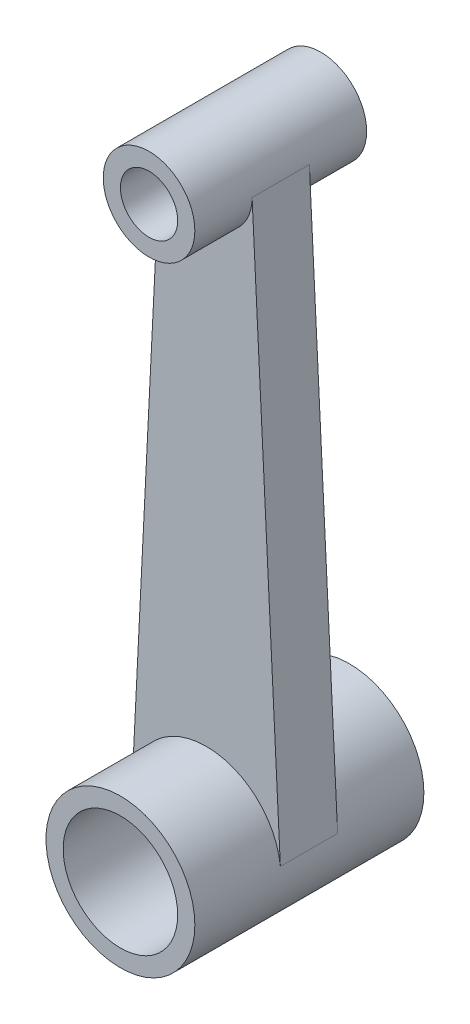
ISO-10303-21;
HEADER;
FILE_DESCRIPTION(('STEP AP214'),'2;1');
FILE_NAME('part.step','',(''),(''),'','','');
FILE_SCHEMA(('AUTOMOTIVE_DESIGN { 1 0 10303 214 1 1 1 1 }'));
ENDSEC;
DATA;
#1=APPLICATION_CONTEXT('core data for automotive mechanical design processes');
#2=APPLICATION_PROTOCOL_DEFINITION('international standard','automotive_design',2000,#1);
#3=PRODUCT_CONTEXT('',#1,'mechanical');
#4=PRODUCT('Part','Part','',(#3));
#5=PRODUCT_RELATED_PRODUCT_CATEGORY('part','',(#4));
#6=PRODUCT_DEFINITION_FORMATION('','',#4);
#7=PRODUCT_DEFINITION_CONTEXT('part definition',#1,'design');
#8=PRODUCT_DEFINITION('design','',#6,#7);
#9=PRODUCT_DEFINITION_SHAPE('','',#8);
#10=(LENGTH_UNIT() NAMED_UNIT(*) SI_UNIT(.MILLI.,.METRE.));
#11=(NAMED_UNIT(*) PLANE_ANGLE_UNIT() SI_UNIT($,.RADIAN.));
#12=(NAMED_UNIT(*) SI_UNIT($,.STERADIAN.) SOLID_ANGLE_UNIT());
#13=UNCERTAINTY_MEASURE_WITH_UNIT(LENGTH_MEASURE(1.E-05),#10,'distance_accuracy_value','');
#14=(GEOMETRIC_REPRESENTATION_CONTEXT(3) GLOBAL_UNCERTAINTY_ASSIGNED_CONTEXT((#13)) GLOBAL_UNIT_ASSIGNED_CONTEXT((#10,
#11,#12)) REPRESENTATION_CONTEXT('',''));
#15=CARTESIAN_POINT('',(0.,0.,0.));
#16=DIRECTION('',(0.,0.,1.));
#17=DIRECTION('',(1.,0.,0.));
#18=AXIS2_PLACEMENT_3D('',#15,#16,#17);
#19=CARTESIAN_POINT('',(0.,0.,-19.05));
#20=DIRECTION('',(0.,0.,1.));
#21=DIRECTION('',(1.,0.,0.));
#22=AXIS2_PLACEMENT_3D('',#19,#20,#21);
#23=CYLINDRICAL_SURFACE('',#22,10.16);
#24=CARTESIAN_POINT('',(0.,0.,-19.05));
#25=DIRECTION('',(0.,0.,1.));
#26=DIRECTION('',(1.,0.,0.));
#27=AXIS2_PLACEMENT_3D('',#24,#25,#26);
#28=CIRCLE('',#27,10.16);
#29=CARTESIAN_POINT('',(10.16,0.,-19.05));
#30=VERTEX_POINT('',#29);
#31=EDGE_CURVE('E11',#30,#30,#28,.T.);
#32=ORIENTED_EDGE('',*,*,#31,.T.);
#33=EDGE_LOOP('',(#32));
#34=FACE_BOUND('',#33,.T.);
#35=CARTESIAN_POINT('',(0.,0.,19.05));
#36=DIRECTION('',(0.,0.,1.));
#37=DIRECTION('',(1.,0.,0.));
#38=AXIS2_PLACEMENT_3D('',#35,#36,#37);
#39=CIRCLE('',#38,10.16);
#40=CARTESIAN_POINT('',(10.16,0.,19.05));
#41=VERTEX_POINT('',#40);
#42=EDGE_CURVE('E117',#41,#41,#39,.T.);
#43=ORIENTED_EDGE('',*,*,#42,.F.);
#44=EDGE_LOOP('',(#43));
#45=FACE_BOUND('',#44,.T.);
#46=DIRECTION('',(0.,0.,1.));
#47=VECTOR('',#46,1.);
#48=CARTESIAN_POINT('',(10.16,0.,-6.35));
#49=LINE('',#48,#47);
#50=CARTESIAN_POINT('',(10.16,0.,-6.35));
#51=VERTEX_POINT('',#50);
#52=CARTESIAN_POINT('',(10.16,0.,6.35));
#53=VERTEX_POINT('',#52);
#54=EDGE_CURVE('E52',#51,#53,#49,.T.);
#55=ORIENTED_EDGE('',*,*,#54,.F.);
#56=CARTESIAN_POINT('',(0.,0.,-6.35));
#57=DIRECTION('',(0.,0.,1.));
#58=DIRECTION('',(1.,0.,0.));
#59=AXIS2_PLACEMENT_3D('',#56,#57,#58);
#60=CIRCLE('',#59,10.16);
#61=CARTESIAN_POINT('',(-10.16,0.,-6.35));
#62=VERTEX_POINT('',#61);
#63=EDGE_CURVE('E47',#62,#51,#60,.T.);
#64=ORIENTED_EDGE('',*,*,#63,.F.);
#65=DIRECTION('',(0.,0.,1.));
#66=VECTOR('',#65,1.);
#67=CARTESIAN_POINT('',(-10.16,0.,-6.35));
#68=LINE('',#67,#66);
#69=CARTESIAN_POINT('',(-10.16,0.,6.35));
#70=VERTEX_POINT('',#69);
#71=EDGE_CURVE('E91',#62,#70,#68,.T.);
#72=ORIENTED_EDGE('',*,*,#71,.T.);
#73=CARTESIAN_POINT('',(0.,0.,6.35));
#74=DIRECTION('',(0.,0.,1.));
#75=DIRECTION('',(1.,0.,0.));
#76=AXIS2_PLACEMENT_3D('',#73,#74,#75);
#77=CIRCLE('',#76,10.16);
#78=EDGE_CURVE('E78',#70,#53,#77,.T.);
#79=ORIENTED_EDGE('',*,*,#78,.T.);
#80=EDGE_LOOP('',(#55,#64,#72,#79));
#81=FACE_BOUND('',#80,.T.);
#82=ADVANCED_FACE('F33',(#34,#45,#81),#23,.T.);
#83=CARTESIAN_POINT('',(0.,0.,-19.05));
#84=DIRECTION('',(0.,0.,1.));
#85=DIRECTION('',(1.,0.,0.));
#86=AXIS2_PLACEMENT_3D('',#83,#84,#85);
#87=PLANE('',#86);
#88=CARTESIAN_POINT('',(0.,0.,-19.05));
#89=DIRECTION('',(0.,0.,1.));
#90=DIRECTION('',(1.,0.,0.));
#91=AXIS2_PLACEMENT_3D('',#88,#89,#90);
#92=CIRCLE('',#91,6.35);
#93=CARTESIAN_POINT('',(6.35,0.,-19.05));
#94=VERTEX_POINT('',#93);
#95=EDGE_CURVE('E40',#94,#94,#92,.T.);
#96=ORIENTED_EDGE('',*,*,#95,.T.);
#97=EDGE_LOOP('',(#96));
#98=FACE_BOUND('',#97,.T.);
#99=ORIENTED_EDGE('',*,*,#31,.F.);
#100=EDGE_LOOP('',(#99));
#101=FACE_BOUND('',#100,.T.);
#102=ADVANCED_FACE('F122',(#98,#101),#87,.F.);
#103=CARTESIAN_POINT('',(0.,0.,-19.05));
#104=DIRECTION('',(0.,0.,1.));
#105=DIRECTION('',(1.,0.,0.));
#106=AXIS2_PLACEMENT_3D('',#103,#104,#105);
#107=CYLINDRICAL_SURFACE('',#106,6.35);
#108=CARTESIAN_POINT('',(0.,0.,19.05));
#109=DIRECTION('',(0.,0.,1.));
#110=DIRECTION('',(1.,0.,0.));
#111=AXIS2_PLACEMENT_3D('',#108,#109,#110);
#112=CIRCLE('',#111,6.35);
#113=CARTESIAN_POINT('',(6.35,0.,19.05));
#114=VERTEX_POINT('',#113);
#115=EDGE_CURVE('E90',#114,#114,#112,.T.);
#116=CARTESIAN_POINT('',(6.35,0.,-19.05));
#117=CARTESIAN_POINT('',(6.35,0.,-18.653125));
#118=CARTESIAN_POINT('',(6.35,0.,-18.25625));
#119=CARTESIAN_POINT('',(6.35,0.,-17.4625));
#120=CARTESIAN_POINT('',(6.35,0.,-17.065625));
#121=CARTESIAN_POINT('',(6.35,0.,-16.271875));
#122=CARTESIAN_POINT('',(6.35,0.,-15.875));
#123=CARTESIAN_POINT('',(6.35,0.,-15.08125));
#124=CARTESIAN_POINT('',(6.35,0.,-14.684375));
#125=CARTESIAN_POINT('',(6.35,0.,-13.890625));
#126=CARTESIAN_POINT('',(6.35,0.,-13.49375));
#127=CARTESIAN_POINT('',(6.35,0.,-12.7));
#128=CARTESIAN_POINT('',(6.35,0.,-12.303125));
#129=CARTESIAN_POINT('',(6.35,0.,-11.509375));
#130=CARTESIAN_POINT('',(6.35,0.,-11.1125));
#131=CARTESIAN_POINT('',(6.35,0.,-10.31875));
#132=CARTESIAN_POINT('',(6.35,0.,-9.921875));
#133=CARTESIAN_POINT('',(6.35,0.,-9.128125));
#134=CARTESIAN_POINT('',(6.35,0.,-8.73125));
#135=CARTESIAN_POINT('',(6.35,0.,-7.9375));
#136=CARTESIAN_POINT('',(6.35,0.,-7.540625));
#137=CARTESIAN_POINT('',(6.35,0.,-6.746875));
#138=CARTESIAN_POINT('',(6.35,0.,-6.35));
#139=CARTESIAN_POINT('',(6.35,0.,-5.55625));
#140=CARTESIAN_POINT('',(6.35,0.,-5.159375));
#141=CARTESIAN_POINT('',(6.35,0.,-4.365625));
#142=CARTESIAN_POINT('',(6.35,0.,-3.96875));
#143=CARTESIAN_POINT('',(6.35,0.,-3.175));
#144=CARTESIAN_POINT('',(6.35,0.,-2.778125));
#145=CARTESIAN_POINT('',(6.35,0.,-1.984375));
#146=CARTESIAN_POINT('',(6.35,0.,-1.5875));
#147=CARTESIAN_POINT('',(6.35,0.,-0.793750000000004));
#148=CARTESIAN_POINT('',(6.35,0.,-0.396875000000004));
#149=CARTESIAN_POINT('',(6.35,0.,0.396874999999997));
#150=CARTESIAN_POINT('',(6.35,0.,0.793749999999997));
#151=CARTESIAN_POINT('',(6.35,0.,1.5875));
#152=CARTESIAN_POINT('',(6.35,0.,1.984375));
#153=CARTESIAN_POINT('',(6.35,0.,2.778125));
#154=CARTESIAN_POINT('',(6.35,0.,3.175));
#155=CARTESIAN_POINT('',(6.35,0.,3.96875));
#156=CARTESIAN_POINT('',(6.35,0.,4.365625));
#157=CARTESIAN_POINT('',(6.35,0.,5.159375));
#158=CARTESIAN_POINT('',(6.35,0.,5.55625));
#159=CARTESIAN_POINT('',(6.35,0.,6.35));
#160=CARTESIAN_POINT('',(6.35,0.,6.746875));
#161=CARTESIAN_POINT('',(6.35,0.,7.540625));
#162=CARTESIAN_POINT('',(6.35,0.,7.9375));
#163=CARTESIAN_POINT('',(6.35,0.,8.73125));
#164=CARTESIAN_POINT('',(6.35,0.,9.128125));
#165=CARTESIAN_POINT('',(6.35,0.,9.921875));
#166=CARTESIAN_POINT('',(6.35,0.,10.31875));
#167=CARTESIAN_POINT('',(6.35,0.,11.1125));
#168=CARTESIAN_POINT('',(6.35,0.,11.509375));
#169=CARTESIAN_POINT('',(6.35,0.,12.303125));
#170=CARTESIAN_POINT('',(6.35,0.,12.7));
#171=CARTESIAN_POINT('',(6.35,0.,13.49375));
#172=CARTESIAN_POINT('',(6.35,0.,13.890625));
#173=CARTESIAN_POINT('',(6.35,0.,14.684375));
#174=CARTESIAN_POINT('',(6.35,0.,15.08125));
#175=CARTESIAN_POINT('',(6.35,0.,15.875));
#176=CARTESIAN_POINT('',(6.35,0.,16.271875));
#177=CARTESIAN_POINT('',(6.35,0.,17.065625));
#178=CARTESIAN_POINT('',(6.35,0.,17.4625));
#179=CARTESIAN_POINT('',(6.35,0.,18.25625));
#180=CARTESIAN_POINT('',(6.35,0.,18.653125));
#181=CARTESIAN_POINT('',(6.35,0.,19.05));
#182=B_SPLINE_CURVE_WITH_KNOTS('',3,(#116,#117,#118,#119,#120,#121,#122,#123,#124,#125,#126,
#127,#128,#129,#130,#131,#132,#133,#134,#135,#136,#137,#138,#139,#140,#141,#142,#143,#144,#145,
#146,#147,#148,#149,#150,#151,#152,#153,#154,#155,#156,#157,#158,#159,#160,#161,#162,#163,#164,
#165,#166,#167,#168,#169,#170,#171,#172,#173,#174,#175,#176,#177,#178,#179,#180,#181),
.UNSPECIFIED.,.F.,.F.,(4,2,2,2,2,2,2,2,2,2,2,2,2,2,2,2,2,2,2,2,2,2,2,2,2,2,2,2,2,2,2,2,4),(0.,
1.190625,2.38125,3.571875,4.7625,5.953125,7.14375,8.334375,9.525,10.715625,11.90625,13.096875,
14.2875,15.478125,16.66875,17.859375,19.05,20.240625,21.43125,22.621875,23.8125,25.003125,
26.19375,27.384375,28.575,29.765625,30.95625,32.146875,33.3375,34.528125,35.71875,36.909375,
38.1),.UNSPECIFIED.);
#183=EDGE_CURVE('BSEAM125',#94,#114,#182,.T.);
#184=ORIENTED_EDGE('',*,*,#95,.F.);
#185=ORIENTED_EDGE('',*,*,#115,.T.);
#186=ORIENTED_EDGE('',*,*,#183,.T.);
#187=ORIENTED_EDGE('',*,*,#183,.F.);
#188=EDGE_LOOP('',(#184,#186,#185,#187));
#189=FACE_BOUND('',#188,.T.);
#190=ADVANCED_FACE('F125',(#189),#107,.F.);
#191=CARTESIAN_POINT('',(0.,0.,19.05));
#192=DIRECTION('',(0.,0.,1.));
#193=DIRECTION('',(1.,0.,0.));
#194=AXIS2_PLACEMENT_3D('',#191,#192,#193);
#195=PLANE('',#194);
#196=ORIENTED_EDGE('',*,*,#42,.T.);
#197=EDGE_LOOP('',(#196));
#198=FACE_BOUND('',#197,.T.);
#199=ORIENTED_EDGE('',*,*,#115,.F.);
#200=EDGE_LOOP('',(#199));
#201=FACE_BOUND('',#200,.T.);
#202=ADVANCED_FACE('F128',(#198,#201),#195,.T.);
#203=CARTESIAN_POINT('',(-10.1346633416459,0.506733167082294,-6.35));
#204=DIRECTION('',(-0.998752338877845,0.0499376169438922,0.));
#205=DIRECTION('',(-0.0499376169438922,-0.998752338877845,0.));
#206=AXIS2_PLACEMENT_3D('',#203,#204,#205);
#207=PLANE('',#206);
#208=DIRECTION('',(0.,0.,1.));
#209=VECTOR('',#208,1.);
#210=CARTESIAN_POINT('',(-16.4276558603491,-125.353117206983,-6.35));
#211=LINE('',#210,#209);
#212=CARTESIAN_POINT('',(-16.4276558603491,-125.353117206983,-6.35));
#213=VERTEX_POINT('',#212);
#214=CARTESIAN_POINT('',(-16.4276558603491,-125.353117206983,6.35));
#215=VERTEX_POINT('',#214);
#216=EDGE_CURVE('E84',#213,#215,#211,.T.);
#217=ORIENTED_EDGE('',*,*,#216,.T.);
#218=DIRECTION('',(-0.0499376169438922,-0.998752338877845,0.));
#219=VECTOR('',#218,1.);
#220=CARTESIAN_POINT('',(-10.1346633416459,0.506733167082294,6.35));
#221=LINE('',#220,#219);
#222=EDGE_CURVE('E71',#70,#215,#221,.T.);
#223=ORIENTED_EDGE('',*,*,#222,.F.);
#224=ORIENTED_EDGE('',*,*,#71,.F.);
#225=DIRECTION('',(-0.0499376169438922,-0.998752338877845,0.));
#226=VECTOR('',#225,1.);
#227=CARTESIAN_POINT('',(-10.1346633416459,0.506733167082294,-6.35));
#228=LINE('',#227,#226);
#229=EDGE_CURVE('E87',#62,#213,#228,.T.);
#230=ORIENTED_EDGE('',*,*,#229,.T.);
#231=EDGE_LOOP('',(#217,#223,#224,#230));
#232=FACE_BOUND('',#231,.T.);
#233=ADVANCED_FACE('F85',(#232),#207,.T.);
#234=CARTESIAN_POINT('',(10.1346633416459,0.506733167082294,-6.35));
#235=DIRECTION('',(-0.998752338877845,-0.0499376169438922,0.));
#236=DIRECTION('',(0.0499376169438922,-0.998752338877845,0.));
#237=AXIS2_PLACEMENT_3D('',#234,#235,#236);
#238=PLANE('',#237);
#239=ORIENTED_EDGE('',*,*,#54,.T.);
#240=DIRECTION('',(0.0499376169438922,-0.998752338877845,0.));
#241=VECTOR('',#240,1.);
#242=CARTESIAN_POINT('',(10.1346633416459,0.506733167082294,6.35));
#243=LINE('',#242,#241);
#244=CARTESIAN_POINT('',(16.4276558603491,-125.353117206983,6.35));
#245=VERTEX_POINT('',#244);
#246=EDGE_CURVE('E97',#53,#245,#243,.T.);
#247=ORIENTED_EDGE('',*,*,#246,.T.);
#248=DIRECTION('',(0.,0.,1.));
#249=VECTOR('',#248,1.);
#250=CARTESIAN_POINT('',(16.4276558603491,-125.353117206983,-6.35));
#251=LINE('',#250,#249);
#252=CARTESIAN_POINT('',(16.4276558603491,-125.353117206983,-6.35));
#253=VERTEX_POINT('',#252);
#254=EDGE_CURVE('E96',#253,#245,#251,.T.);
#255=ORIENTED_EDGE('',*,*,#254,.F.);
#256=DIRECTION('',(0.0499376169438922,-0.998752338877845,0.));
#257=VECTOR('',#256,1.);
#258=CARTESIAN_POINT('',(10.1346633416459,0.506733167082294,-6.35));
#259=LINE('',#258,#257);
#260=EDGE_CURVE('E108',#51,#253,#259,.T.);
#261=ORIENTED_EDGE('',*,*,#260,.F.);
#262=EDGE_LOOP('',(#239,#247,#255,#261));
#263=FACE_BOUND('',#262,.T.);
#264=ADVANCED_FACE('F138',(#263),#238,.F.);
#265=CARTESIAN_POINT('',(0.,0.,-6.35));
#266=DIRECTION('',(0.,0.,1.));
#267=DIRECTION('',(1.,0.,0.));
#268=AXIS2_PLACEMENT_3D('',#265,#266,#267);
#269=PLANE('',#268);
#270=CARTESIAN_POINT('',(0.,-127.,-6.35));
#271=DIRECTION('',(0.,0.,1.));
#272=DIRECTION('',(1.,0.,0.));
#273=AXIS2_PLACEMENT_3D('',#270,#271,#272);
#274=CIRCLE('',#273,16.51);
#275=EDGE_CURVE('E80',#253,#213,#274,.T.);
#276=ORIENTED_EDGE('',*,*,#275,.T.);
#277=ORIENTED_EDGE('',*,*,#229,.F.);
#278=ORIENTED_EDGE('',*,*,#63,.T.);
#279=ORIENTED_EDGE('',*,*,#260,.T.);
#280=EDGE_LOOP('',(#276,#277,#278,#279));
#281=FACE_BOUND('',#280,.T.);
#282=ADVANCED_FACE('F180',(#281),#269,.F.);
#283=CARTESIAN_POINT('',(0.,0.,6.35));
#284=DIRECTION('',(0.,0.,1.));
#285=DIRECTION('',(1.,0.,0.));
#286=AXIS2_PLACEMENT_3D('',#283,#284,#285);
#287=PLANE('',#286);
#288=CARTESIAN_POINT('',(0.,-127.,6.35));
#289=DIRECTION('',(0.,0.,1.));
#290=DIRECTION('',(1.,0.,0.));
#291=AXIS2_PLACEMENT_3D('',#288,#289,#290);
#292=CIRCLE('',#291,16.51);
#293=EDGE_CURVE('E76',#245,#215,#292,.T.);
#294=ORIENTED_EDGE('',*,*,#293,.F.);
#295=ORIENTED_EDGE('',*,*,#246,.F.);
#296=ORIENTED_EDGE('',*,*,#78,.F.);
#297=ORIENTED_EDGE('',*,*,#222,.T.);
#298=EDGE_LOOP('',(#294,#295,#296,#297));
#299=FACE_BOUND('',#298,.T.);
#300=ADVANCED_FACE('F73',(#299),#287,.T.);
#301=CARTESIAN_POINT('',(0.,-127.,-25.4));
#302=DIRECTION('',(0.,0.,1.));
#303=DIRECTION('',(1.,0.,0.));
#304=AXIS2_PLACEMENT_3D('',#301,#302,#303);
#305=CYLINDRICAL_SURFACE('',#304,16.51);
#306=CARTESIAN_POINT('',(0.,-127.,25.4));
#307=DIRECTION('',(0.,0.,1.));
#308=DIRECTION('',(1.,0.,0.));
#309=AXIS2_PLACEMENT_3D('',#306,#307,#308);
#310=CIRCLE('',#309,16.51);
#311=CARTESIAN_POINT('',(16.51,-127.,25.4));
#312=VERTEX_POINT('',#311);
#313=EDGE_CURVE('E241',#312,#312,#310,.T.);
#314=ORIENTED_EDGE('',*,*,#313,.F.);
#315=EDGE_LOOP('',(#314));
#316=FACE_BOUND('',#315,.T.);
#317=CARTESIAN_POINT('',(0.,-127.,-25.4));
#318=DIRECTION('',(0.,0.,1.));
#319=DIRECTION('',(1.,0.,0.));
#320=AXIS2_PLACEMENT_3D('',#317,#318,#319);
#321=CIRCLE('',#320,16.51);
#322=CARTESIAN_POINT('',(16.51,-127.,-25.4));
#323=VERTEX_POINT('',#322);
#324=EDGE_CURVE('E98',#323,#323,#321,.T.);
#325=ORIENTED_EDGE('',*,*,#324,.T.);
#326=EDGE_LOOP('',(#325));
#327=FACE_BOUND('',#326,.T.);
#328=ORIENTED_EDGE('',*,*,#275,.F.);
#329=ORIENTED_EDGE('',*,*,#254,.T.);
#330=ORIENTED_EDGE('',*,*,#293,.T.);
#331=ORIENTED_EDGE('',*,*,#216,.F.);
#332=EDGE_LOOP('',(#328,#329,#330,#331));
#333=FACE_BOUND('',#332,.T.);
#334=ADVANCED_FACE('F94',(#316,#327,#333),#305,.T.);
#335=CARTESIAN_POINT('',(0.,-127.,-25.4));
#336=DIRECTION('',(0.,0.,1.));
#337=DIRECTION('',(1.,0.,0.));
#338=AXIS2_PLACEMENT_3D('',#335,#336,#337);
#339=PLANE('',#338);
#340=CARTESIAN_POINT('',(0.,-127.,-25.4));
#341=DIRECTION('',(0.,0.,1.));
#342=DIRECTION('',(1.,0.,0.));
#343=AXIS2_PLACEMENT_3D('',#340,#341,#342);
#344=CIRCLE('',#343,12.7);
#345=CARTESIAN_POINT('',(12.7,-127.,-25.4));
#346=VERTEX_POINT('',#345);
#347=EDGE_CURVE('E102',#346,#346,#344,.T.);
#348=ORIENTED_EDGE('',*,*,#347,.T.);
#349=EDGE_LOOP('',(#348));
#350=FACE_BOUND('',#349,.T.);
#351=ORIENTED_EDGE('',*,*,#324,.F.);
#352=EDGE_LOOP('',(#351));
#353=FACE_BOUND('',#352,.T.);
#354=ADVANCED_FACE('F205',(#350,#353),#339,.F.);
#355=CARTESIAN_POINT('',(0.,-127.,-25.4));
#356=DIRECTION('',(0.,0.,1.));
#357=DIRECTION('',(1.,0.,0.));
#358=AXIS2_PLACEMENT_3D('',#355,#356,#357);
#359=CYLINDRICAL_SURFACE('',#358,12.7);
#360=ORIENTED_EDGE('',*,*,#347,.F.);
#361=EDGE_LOOP('',(#360));
#362=FACE_BOUND('',#361,.T.);
#363=CARTESIAN_POINT('',(0.,-127.,25.4));
#364=DIRECTION('',(0.,0.,1.));
#365=DIRECTION('',(1.,0.,0.));
#366=AXIS2_PLACEMENT_3D('',#363,#364,#365);
#367=CIRCLE('',#366,12.7);
#368=CARTESIAN_POINT('',(12.7,-127.,25.4));
#369=VERTEX_POINT('',#368);
#370=EDGE_CURVE('E244',#369,#369,#367,.T.);
#371=ORIENTED_EDGE('',*,*,#370,.T.);
#372=EDGE_LOOP('',(#371));
#373=FACE_BOUND('',#372,.T.);
#374=ADVANCED_FACE('F215',(#362,#373),#359,.F.);
#375=CARTESIAN_POINT('',(0.,-127.,25.4));
#376=DIRECTION('',(0.,0.,1.));
#377=DIRECTION('',(1.,0.,0.));
#378=AXIS2_PLACEMENT_3D('',#375,#376,#377);
#379=PLANE('',#378);
#380=ORIENTED_EDGE('',*,*,#313,.T.);
#381=EDGE_LOOP('',(#380));
#382=FACE_BOUND('',#381,.T.);
#383=ORIENTED_EDGE('',*,*,#370,.F.);
#384=EDGE_LOOP('',(#383));
#385=FACE_BOUND('',#384,.T.);
#386=ADVANCED_FACE('F225',(#382,#385),#379,.T.);
#387=CLOSED_SHELL('',(#82,#102,#190,#202,#233,#264,#282,#300,#334,#354,#374,#386));
#388=MANIFOLD_SOLID_BREP('B2',#387);
#389=ADVANCED_BREP_SHAPE_REPRESENTATION('',(#18,#388),#14);
#390=SHAPE_DEFINITION_REPRESENTATION(#9,#389);
ENDSEC;
END-ISO-10303-21;
